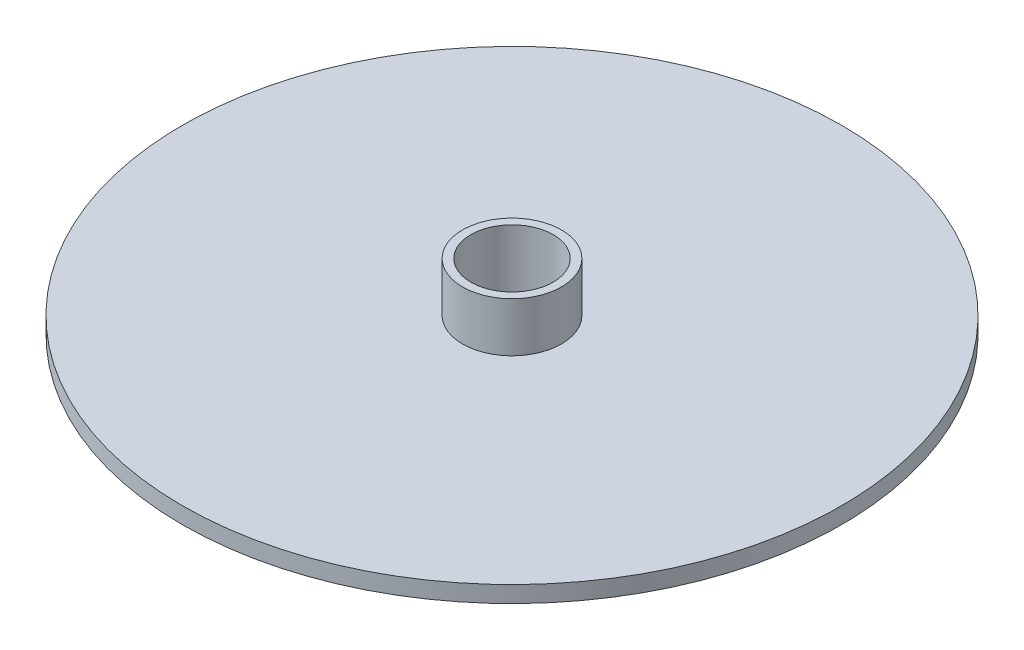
ISO-10303-21;
HEADER;
FILE_DESCRIPTION(('STEP AP214'),'2;1');
FILE_NAME('part.step','',(''),(''),'','','');
FILE_SCHEMA(('AUTOMOTIVE_DESIGN { 1 0 10303 214 1 1 1 1 }'));
ENDSEC;
DATA;
#1=APPLICATION_CONTEXT('core data for automotive mechanical design processes');
#2=APPLICATION_PROTOCOL_DEFINITION('international standard','automotive_design',2000,#1);
#3=PRODUCT_CONTEXT('',#1,'mechanical');
#4=PRODUCT('Part','Part','',(#3));
#5=PRODUCT_RELATED_PRODUCT_CATEGORY('part','',(#4));
#6=PRODUCT_DEFINITION_FORMATION('','',#4);
#7=PRODUCT_DEFINITION_CONTEXT('part definition',#1,'design');
#8=PRODUCT_DEFINITION('design','',#6,#7);
#9=PRODUCT_DEFINITION_SHAPE('','',#8);
#10=(LENGTH_UNIT() NAMED_UNIT(*) SI_UNIT(.MILLI.,.METRE.));
#11=(NAMED_UNIT(*) PLANE_ANGLE_UNIT() SI_UNIT($,.RADIAN.));
#12=(NAMED_UNIT(*) SI_UNIT($,.STERADIAN.) SOLID_ANGLE_UNIT());
#13=UNCERTAINTY_MEASURE_WITH_UNIT(LENGTH_MEASURE(1.E-05),#10,'distance_accuracy_value','');
#14=(GEOMETRIC_REPRESENTATION_CONTEXT(3) GLOBAL_UNCERTAINTY_ASSIGNED_CONTEXT((#13)) GLOBAL_UNIT_ASSIGNED_CONTEXT((#10,
#11,#12)) REPRESENTATION_CONTEXT('',''));
#15=CARTESIAN_POINT('',(0.,0.,0.));
#16=DIRECTION('',(0.,0.,1.));
#17=DIRECTION('',(1.,0.,0.));
#18=AXIS2_PLACEMENT_3D('',#15,#16,#17);
#19=CARTESIAN_POINT('',(0.,50.,0.));
#20=DIRECTION('',(0.,1.,0.));
#21=DIRECTION('',(0.,0.,1.));
#22=AXIS2_PLACEMENT_3D('',#19,#20,#21);
#23=PLANE('',#22);
#24=CARTESIAN_POINT('',(0.,50.,0.));
#25=DIRECTION('',(0.,1.,0.));
#26=DIRECTION('',(0.,0.,1.));
#27=AXIS2_PLACEMENT_3D('',#24,#25,#26);
#28=CIRCLE('',#27,1000.);
#29=CARTESIAN_POINT('',(0.,50.,1000.));
#30=VERTEX_POINT('',#29);
#31=EDGE_CURVE('E10',#30,#30,#28,.T.);
#32=ORIENTED_EDGE('',*,*,#31,.T.);
#33=EDGE_LOOP('',(#32));
#34=FACE_BOUND('',#33,.T.);
#35=CARTESIAN_POINT('',(0.,50.,0.));
#36=DIRECTION('',(0.,1.,0.));
#37=DIRECTION('',(0.,0.,1.));
#38=AXIS2_PLACEMENT_3D('',#35,#36,#37);
#39=CIRCLE('',#38,150.);
#40=CARTESIAN_POINT('',(0.,50.,150.));
#41=VERTEX_POINT('',#40);
#42=EDGE_CURVE('E50',#41,#41,#39,.T.);
#43=ORIENTED_EDGE('',*,*,#42,.F.);
#44=EDGE_LOOP('',(#43));
#45=FACE_BOUND('',#44,.T.);
#46=ADVANCED_FACE('F34',(#34,#45),#23,.T.);
#47=CARTESIAN_POINT('',(0.,50.,0.));
#48=DIRECTION('',(0.,-1.,0.));
#49=DIRECTION('',(0.,0.,-1.));
#50=AXIS2_PLACEMENT_3D('',#47,#48,#49);
#51=CYLINDRICAL_SURFACE('',#50,1000.);
#52=ORIENTED_EDGE('',*,*,#31,.F.);
#53=EDGE_LOOP('',(#52));
#54=FACE_BOUND('',#53,.T.);
#55=CARTESIAN_POINT('',(0.,0.,0.));
#56=DIRECTION('',(0.,1.,0.));
#57=DIRECTION('',(0.,0.,1.));
#58=AXIS2_PLACEMENT_3D('',#55,#56,#57);
#59=CIRCLE('',#58,1000.);
#60=CARTESIAN_POINT('',(0.,0.,1000.));
#61=VERTEX_POINT('',#60);
#62=EDGE_CURVE('E38',#61,#61,#59,.T.);
#63=ORIENTED_EDGE('',*,*,#62,.T.);
#64=EDGE_LOOP('',(#63));
#65=FACE_BOUND('',#64,.T.);
#66=ADVANCED_FACE('F36',(#54,#65),#51,.T.);
#67=CARTESIAN_POINT('',(0.,0.,0.));
#68=DIRECTION('',(0.,1.,0.));
#69=DIRECTION('',(0.,0.,1.));
#70=AXIS2_PLACEMENT_3D('',#67,#68,#69);
#71=PLANE('',#70);
#72=CARTESIAN_POINT('',(0.,0.,0.));
#73=DIRECTION('',(0.,1.,0.));
#74=DIRECTION('',(0.,0.,1.));
#75=AXIS2_PLACEMENT_3D('',#72,#73,#74);
#76=CIRCLE('',#75,125.);
#77=CARTESIAN_POINT('',(0.,0.,125.));
#78=VERTEX_POINT('',#77);
#79=EDGE_CURVE('E45',#78,#78,#76,.T.);
#80=ORIENTED_EDGE('',*,*,#79,.T.);
#81=EDGE_LOOP('',(#80));
#82=FACE_BOUND('',#81,.T.);
#83=ORIENTED_EDGE('',*,*,#62,.F.);
#84=EDGE_LOOP('',(#83));
#85=FACE_BOUND('',#84,.T.);
#86=ADVANCED_FACE('F72',(#82,#85),#71,.F.);
#87=CARTESIAN_POINT('',(0.,0.,0.));
#88=DIRECTION('',(0.,1.,0.));
#89=DIRECTION('',(0.,0.,1.));
#90=AXIS2_PLACEMENT_3D('',#87,#88,#89);
#91=CYLINDRICAL_SURFACE('',#90,125.);
#92=ORIENTED_EDGE('',*,*,#79,.F.);
#93=EDGE_LOOP('',(#92));
#94=FACE_BOUND('',#93,.T.);
#95=CARTESIAN_POINT('',(0.,200.,0.));
#96=DIRECTION('',(0.,1.,0.));
#97=DIRECTION('',(0.,0.,1.));
#98=AXIS2_PLACEMENT_3D('',#95,#96,#97);
#99=CIRCLE('',#98,125.);
#100=CARTESIAN_POINT('',(0.,200.,125.));
#101=VERTEX_POINT('',#100);
#102=EDGE_CURVE('E53',#101,#101,#99,.T.);
#103=ORIENTED_EDGE('',*,*,#102,.T.);
#104=EDGE_LOOP('',(#103));
#105=FACE_BOUND('',#104,.T.);
#106=ADVANCED_FACE('F59',(#94,#105),#91,.F.);
#107=CARTESIAN_POINT('',(0.,200.,0.));
#108=DIRECTION('',(0.,1.,0.));
#109=DIRECTION('',(0.,0.,1.));
#110=AXIS2_PLACEMENT_3D('',#107,#108,#109);
#111=PLANE('',#110);
#112=CARTESIAN_POINT('',(0.,200.,0.));
#113=DIRECTION('',(0.,1.,0.));
#114=DIRECTION('',(0.,0.,1.));
#115=AXIS2_PLACEMENT_3D('',#112,#113,#114);
#116=CIRCLE('',#115,150.);
#117=CARTESIAN_POINT('',(0.,200.,150.));
#118=VERTEX_POINT('',#117);
#119=EDGE_CURVE('E49',#118,#118,#116,.T.);
#120=ORIENTED_EDGE('',*,*,#119,.T.);
#121=EDGE_LOOP('',(#120));
#122=FACE_BOUND('',#121,.T.);
#123=ORIENTED_EDGE('',*,*,#102,.F.);
#124=EDGE_LOOP('',(#123));
#125=FACE_BOUND('',#124,.T.);
#126=ADVANCED_FACE('F61',(#122,#125),#111,.T.);
#127=CARTESIAN_POINT('',(0.,200.,0.));
#128=DIRECTION('',(0.,-1.,0.));
#129=DIRECTION('',(0.,0.,-1.));
#130=AXIS2_PLACEMENT_3D('',#127,#128,#129);
#131=CYLINDRICAL_SURFACE('',#130,150.);
#132=ORIENTED_EDGE('',*,*,#119,.F.);
#133=EDGE_LOOP('',(#132));
#134=FACE_BOUND('',#133,.T.);
#135=ORIENTED_EDGE('',*,*,#42,.T.);
#136=EDGE_LOOP('',(#135));
#137=FACE_BOUND('',#136,.T.);
#138=ADVANCED_FACE('F63',(#134,#137),#131,.T.);
#139=CLOSED_SHELL('',(#46,#66,#86,#106,#126,#138));
#140=MANIFOLD_SOLID_BREP('B2',#139);
#141=ADVANCED_BREP_SHAPE_REPRESENTATION('',(#18,#140),#14);
#142=SHAPE_DEFINITION_REPRESENTATION(#9,#141);
ENDSEC;
END-ISO-10303-21;
